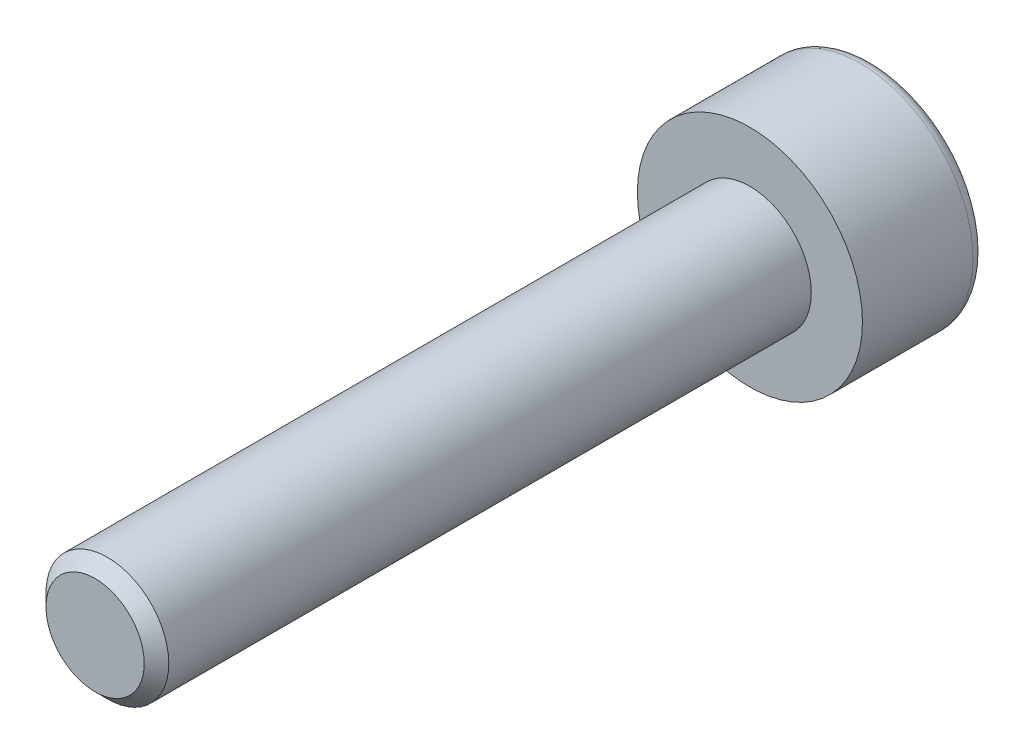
from build123d import *

# Parameters (mm, degrees)
ENLEV_MAT_EXTRU1_DEPTH = 1.3
ESQUISSE3_W            = 1.5
ESQUISSE3_H            = 16
CHANFREIN1_SIZE        = 0.3


with BuildPart() as part:
    # Esquisse1 → Base-R_volution (revolve)
    with BuildSketch(Plane(origin=(0, 0, 0), x_dir=(1, 0, 0), z_dir=(0, 1, 0)), mode=Mode.PRIVATE) as base_r_volution_sk:
        with BuildLine():
            Line((0, 0), (2.75, 0))
            Line((2.75, 0), (2.75, 2.7))
            ThreePointArc((2.75, 2.7), (2.662132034, 2.912132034), (2.45, 3))
            Line((2.45, 3), (0, 3))
            Line((0, 3), (0, 0))
        make_face()
    revolve(base_r_volution_sk.sketch.rotate(Axis((0, 0, 0), (0, 0, -1)), 180), axis=Axis((0, 0, 0), (0, 0, -1)))

    # Esquisse2 → enlev-mat-Extru1 (cut)
    with BuildSketch(Plane.XY.offset(-3)):
        Polygon((1.25, -0.721687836), (1.25, 0.721687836), (0, 1.443375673), (-1.25, 0.721687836), (-1.25, -0.721687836), (0, -1.443375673), align=None)
    extrude(amount=ENLEV_MAT_EXTRU1_DEPTH, mode=Mode.SUBTRACT)

    # Esquisse3 → Boss.-R_vol.1 (revolve)
    with BuildSketch(Plane(origin=(0, 0, 0), x_dir=(1, 0, 0), z_dir=(0, 1, 0))):
        with Locations((0.75, -8)):
            Rectangle(ESQUISSE3_W, ESQUISSE3_H)
    revolve(axis=Axis((0, 0, 0), (0, 0, 1)))

    # Chanfrein1
    chanfrein1_edges = [part.edges().sort_by_distance(p)[0] for p in [
        (-1.5, 0, 16),
    ]]
    chamfer(chanfrein1_edges, length=CHANFREIN1_SIZE)


solid = part.part
